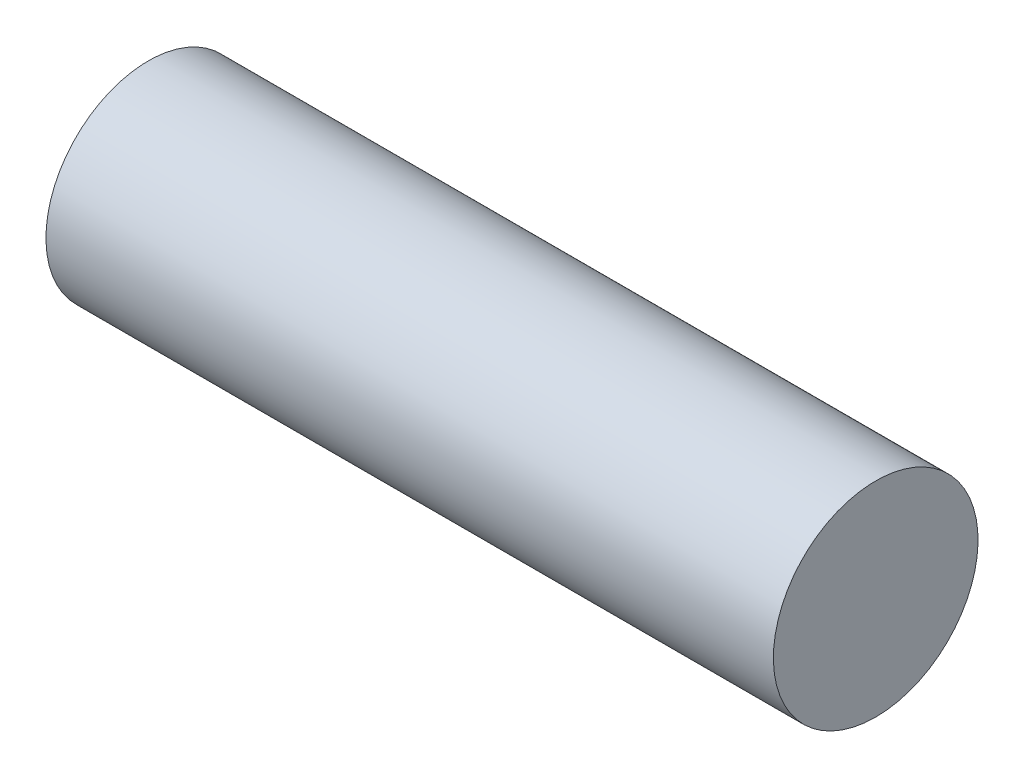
from build123d import *

# Parameters (mm, degrees)
SKETCH1_W = 57.785
SKETCH1_H = 8.128


with BuildPart() as part:
    # Sketch1 → Revolve1 (revolve)
    with BuildSketch(Plane.XY, mode=Mode.PRIVATE) as revolve1_sk:
        with Locations((28.8925, 4.064)):
            Rectangle(SKETCH1_W, SKETCH1_H)
    revolve(revolve1_sk.sketch.rotate(Axis((57.785, 0, 0), (-1, 0, 0)), 180), axis=Axis((57.785, 0, 0), (-1, 0, 0)))


solid = part.part
